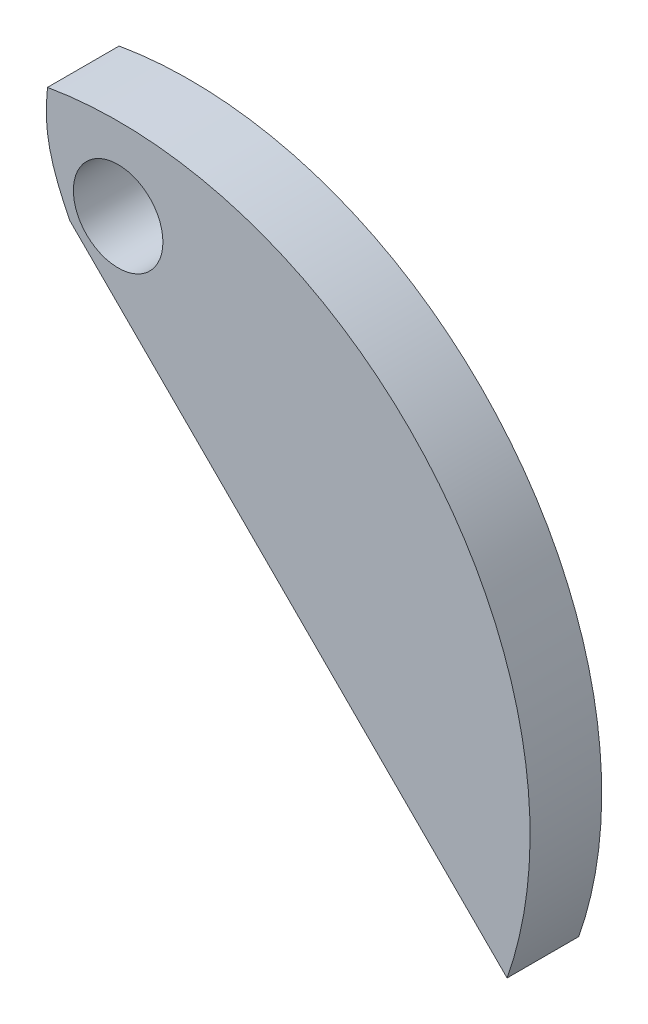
ISO-10303-21;
HEADER;
FILE_DESCRIPTION(('STEP AP214'),'2;1');
FILE_NAME('part.step','',(''),(''),'','','');
FILE_SCHEMA(('AUTOMOTIVE_DESIGN { 1 0 10303 214 1 1 1 1 }'));
ENDSEC;
DATA;
#1=APPLICATION_CONTEXT('core data for automotive mechanical design processes');
#2=APPLICATION_PROTOCOL_DEFINITION('international standard','automotive_design',2000,#1);
#3=PRODUCT_CONTEXT('',#1,'mechanical');
#4=PRODUCT('Part','Part','',(#3));
#5=PRODUCT_RELATED_PRODUCT_CATEGORY('part','',(#4));
#6=PRODUCT_DEFINITION_FORMATION('','',#4);
#7=PRODUCT_DEFINITION_CONTEXT('part definition',#1,'design');
#8=PRODUCT_DEFINITION('design','',#6,#7);
#9=PRODUCT_DEFINITION_SHAPE('','',#8);
#10=(LENGTH_UNIT() NAMED_UNIT(*) SI_UNIT(.MILLI.,.METRE.));
#11=(NAMED_UNIT(*) PLANE_ANGLE_UNIT() SI_UNIT($,.RADIAN.));
#12=(NAMED_UNIT(*) SI_UNIT($,.STERADIAN.) SOLID_ANGLE_UNIT());
#13=UNCERTAINTY_MEASURE_WITH_UNIT(LENGTH_MEASURE(1.E-05),#10,'distance_accuracy_value','');
#14=(GEOMETRIC_REPRESENTATION_CONTEXT(3) GLOBAL_UNCERTAINTY_ASSIGNED_CONTEXT((#13)) GLOBAL_UNIT_ASSIGNED_CONTEXT((#10,
#11,#12)) REPRESENTATION_CONTEXT('',''));
#15=CARTESIAN_POINT('',(0.,0.,0.));
#16=DIRECTION('',(0.,0.,1.));
#17=DIRECTION('',(1.,0.,0.));
#18=AXIS2_PLACEMENT_3D('',#15,#16,#17);
#19=CARTESIAN_POINT('',(0.,0.,2.));
#20=DIRECTION('',(0.,0.,1.));
#21=DIRECTION('',(1.,0.,0.));
#22=AXIS2_PLACEMENT_3D('',#19,#20,#21);
#23=PLANE('',#22);
#24=CARTESIAN_POINT('',(0.,0.,2.));
#25=DIRECTION('',(0.,0.,1.));
#26=DIRECTION('',(1.,0.,0.));
#27=AXIS2_PLACEMENT_3D('',#24,#25,#26);
#28=CIRCLE('',#27,11.5);
#29=CARTESIAN_POINT('',(10.8584431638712,-3.78737535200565,2.));
#30=VERTEX_POINT('',#29);
#31=CARTESIAN_POINT('',(-1.97212981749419,11.329638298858,2.));
#32=VERTEX_POINT('',#31);
#33=EDGE_CURVE('E414',#30,#32,#28,.T.);
#34=ORIENTED_EDGE('',*,*,#33,.T.);
#35=CARTESIAN_POINT('',(-1.97212981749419,11.329638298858,2.));
#36=CARTESIAN_POINT('',(-1.98909754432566,11.1379393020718,2.));
#37=CARTESIAN_POINT('',(-2.04612723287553,10.4936258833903,2.));
#38=CARTESIAN_POINT('',(-1.85767721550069,9.48253583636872,2.));
#39=CARTESIAN_POINT('',(-1.50895111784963,8.7493599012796,2.));
#40=CARTESIAN_POINT('',(-1.35534560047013,8.42641341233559,2.));
#41=B_SPLINE_CURVE_WITH_KNOTS('',3,(#35,#36,#37,#38,#39,#40),.UNSPECIFIED.,.F.,.F.,(4,1,1,4),
(0.,0.19157891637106,0.643909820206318,1.),.UNSPECIFIED.);
#42=CARTESIAN_POINT('',(-1.35534560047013,8.42641341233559,2.));
#43=VERTEX_POINT('',#42);
#44=EDGE_CURVE('E371',#32,#43,#41,.T.);
#45=ORIENTED_EDGE('',*,*,#44,.T.);
#46=DIRECTION('',(0.707106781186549,-0.707106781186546,0.));
#47=VECTOR('',#46,1.);
#48=CARTESIAN_POINT('',(10.8584431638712,-3.78737535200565,2.));
#49=LINE('',#48,#47);
#50=EDGE_CURVE('E367',#43,#30,#49,.T.);
#51=ORIENTED_EDGE('',*,*,#50,.T.);
#52=EDGE_LOOP('',(#34,#45,#51));
#53=FACE_BOUND('',#52,.T.);
#54=CARTESIAN_POINT('',(0.,9.2,2.));
#55=DIRECTION('',(0.,0.,1.));
#56=DIRECTION('',(1.,0.,0.));
#57=AXIS2_PLACEMENT_3D('',#54,#55,#56);
#58=CIRCLE('',#57,1.25);
#59=CARTESIAN_POINT('',(1.25,9.2,2.));
#60=VERTEX_POINT('',#59);
#61=EDGE_CURVE('E401',#60,#60,#58,.T.);
#62=ORIENTED_EDGE('',*,*,#61,.F.);
#63=EDGE_LOOP('',(#62));
#64=FACE_BOUND('',#63,.T.);
#65=ADVANCED_FACE('F352',(#53,#64),#23,.T.);
#66=CARTESIAN_POINT('',(0.,0.,0.));
#67=DIRECTION('',(0.,0.,1.));
#68=DIRECTION('',(1.,0.,0.));
#69=AXIS2_PLACEMENT_3D('',#66,#67,#68);
#70=PLANE('',#69);
#71=CARTESIAN_POINT('',(0.,0.,0.));
#72=DIRECTION('',(0.,0.,1.));
#73=DIRECTION('',(1.,0.,0.));
#74=AXIS2_PLACEMENT_3D('',#71,#72,#73);
#75=CIRCLE('',#74,11.5);
#76=CARTESIAN_POINT('',(10.8584431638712,-3.78737535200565,0.));
#77=VERTEX_POINT('',#76);
#78=CARTESIAN_POINT('',(-1.97212981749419,11.329638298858,0.));
#79=VERTEX_POINT('',#78);
#80=EDGE_CURVE('E390',#77,#79,#75,.T.);
#81=ORIENTED_EDGE('',*,*,#80,.F.);
#82=DIRECTION('',(0.707106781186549,-0.707106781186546,0.));
#83=VECTOR('',#82,1.);
#84=CARTESIAN_POINT('',(10.8584431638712,-3.78737535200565,0.));
#85=LINE('',#84,#83);
#86=CARTESIAN_POINT('',(-1.35534560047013,8.42641341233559,0.));
#87=VERTEX_POINT('',#86);
#88=EDGE_CURVE('E391',#87,#77,#85,.T.);
#89=ORIENTED_EDGE('',*,*,#88,.F.);
#90=CARTESIAN_POINT('',(-1.97212981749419,11.329638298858,0.));
#91=CARTESIAN_POINT('',(-1.98909754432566,11.1379393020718,0.));
#92=CARTESIAN_POINT('',(-2.04612723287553,10.4936258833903,0.));
#93=CARTESIAN_POINT('',(-1.85767721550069,9.48253583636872,0.));
#94=CARTESIAN_POINT('',(-1.50895111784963,8.7493599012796,0.));
#95=CARTESIAN_POINT('',(-1.35534560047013,8.42641341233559,0.));
#96=B_SPLINE_CURVE_WITH_KNOTS('',3,(#90,#91,#92,#93,#94,#95),.UNSPECIFIED.,.F.,.F.,(4,1,1,4),
(0.,0.19157891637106,0.643909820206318,1.),.UNSPECIFIED.);
#97=EDGE_CURVE('E386',#79,#87,#96,.T.);
#98=ORIENTED_EDGE('',*,*,#97,.F.);
#99=EDGE_LOOP('',(#81,#89,#98));
#100=FACE_BOUND('',#99,.T.);
#101=CARTESIAN_POINT('',(0.,9.2,0.));
#102=DIRECTION('',(0.,0.,1.));
#103=DIRECTION('',(1.,0.,0.));
#104=AXIS2_PLACEMENT_3D('',#101,#102,#103);
#105=CIRCLE('',#104,1.25);
#106=CARTESIAN_POINT('',(1.25,9.2,0.));
#107=VERTEX_POINT('',#106);
#108=EDGE_CURVE('E404',#107,#107,#105,.T.);
#109=ORIENTED_EDGE('',*,*,#108,.T.);
#110=EDGE_LOOP('',(#109));
#111=FACE_BOUND('',#110,.T.);
#112=ADVANCED_FACE('F387',(#100,#111),#70,.F.);
#113=CARTESIAN_POINT('',(0.,0.,2.));
#114=DIRECTION('',(0.,0.,-1.));
#115=DIRECTION('',(-1.,0.,0.));
#116=AXIS2_PLACEMENT_3D('',#113,#114,#115);
#117=CYLINDRICAL_SURFACE('',#116,11.5);
#118=ORIENTED_EDGE('',*,*,#80,.T.);
#119=DIRECTION('',(0.,0.,-1.));
#120=VECTOR('',#119,1.);
#121=CARTESIAN_POINT('',(-1.97212981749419,11.329638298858,2.));
#122=LINE('',#121,#120);
#123=EDGE_CURVE('E11',#32,#79,#122,.T.);
#124=ORIENTED_EDGE('',*,*,#123,.F.);
#125=ORIENTED_EDGE('',*,*,#33,.F.);
#126=DIRECTION('',(0.,0.,-1.));
#127=VECTOR('',#126,1.);
#128=CARTESIAN_POINT('',(10.8584431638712,-3.78737535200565,2.));
#129=LINE('',#128,#127);
#130=EDGE_CURVE('E400',#30,#77,#129,.T.);
#131=ORIENTED_EDGE('',*,*,#130,.T.);
#132=EDGE_LOOP('',(#118,#124,#125,#131));
#133=FACE_BOUND('',#132,.T.);
#134=ADVANCED_FACE('F354',(#133),#117,.T.);
#135=DIRECTION('',(0.,0.,-1.));
#136=VECTOR('',#135,1.);
#137=SURFACE_OF_LINEAR_EXTRUSION('',#41,#136);
#138=ORIENTED_EDGE('',*,*,#97,.T.);
#139=DIRECTION('',(0.,0.,-1.));
#140=VECTOR('',#139,1.);
#141=CARTESIAN_POINT('',(-1.35534560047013,8.42641341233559,2.));
#142=LINE('',#141,#140);
#143=EDGE_CURVE('E360',#43,#87,#142,.T.);
#144=ORIENTED_EDGE('',*,*,#143,.F.);
#145=ORIENTED_EDGE('',*,*,#44,.F.);
#146=ORIENTED_EDGE('',*,*,#123,.T.);
#147=EDGE_LOOP('',(#138,#144,#145,#146));
#148=FACE_BOUND('',#147,.T.);
#149=ADVANCED_FACE('F396',(#148),#137,.F.);
#150=CARTESIAN_POINT('',(10.8584431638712,-3.78737535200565,2.));
#151=DIRECTION('',(0.707106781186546,0.707106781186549,0.));
#152=DIRECTION('',(-0.707106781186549,0.707106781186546,0.));
#153=AXIS2_PLACEMENT_3D('',#150,#151,#152);
#154=PLANE('',#153);
#155=ORIENTED_EDGE('',*,*,#88,.T.);
#156=ORIENTED_EDGE('',*,*,#130,.F.);
#157=ORIENTED_EDGE('',*,*,#50,.F.);
#158=ORIENTED_EDGE('',*,*,#143,.T.);
#159=EDGE_LOOP('',(#155,#156,#157,#158));
#160=FACE_BOUND('',#159,.T.);
#161=ADVANCED_FACE('F426',(#160),#154,.F.);
#162=CARTESIAN_POINT('',(0.,9.2,2.));
#163=DIRECTION('',(0.,0.,-1.));
#164=DIRECTION('',(-1.,0.,0.));
#165=AXIS2_PLACEMENT_3D('',#162,#163,#164);
#166=CYLINDRICAL_SURFACE('',#165,1.25);
#167=ORIENTED_EDGE('',*,*,#61,.T.);
#168=EDGE_LOOP('',(#167));
#169=FACE_BOUND('',#168,.T.);
#170=ORIENTED_EDGE('',*,*,#108,.F.);
#171=EDGE_LOOP('',(#170));
#172=FACE_BOUND('',#171,.T.);
#173=ADVANCED_FACE('F429',(#169,#172),#166,.F.);
#174=CLOSED_SHELL('',(#65,#112,#134,#149,#161,#173));
#175=MANIFOLD_SOLID_BREP('B2',#174);
#176=ADVANCED_BREP_SHAPE_REPRESENTATION('',(#18,#175),#14);
#177=SHAPE_DEFINITION_REPRESENTATION(#9,#176);
ENDSEC;
END-ISO-10303-21;
